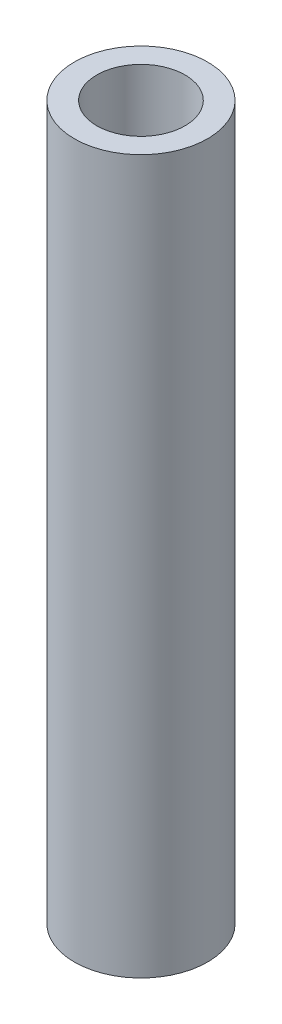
ISO-10303-21;
HEADER;
FILE_DESCRIPTION(('STEP AP214'),'2;1');
FILE_NAME('part.step','',(''),(''),'','','');
FILE_SCHEMA(('AUTOMOTIVE_DESIGN { 1 0 10303 214 1 1 1 1 }'));
ENDSEC;
DATA;
#1=APPLICATION_CONTEXT('core data for automotive mechanical design processes');
#2=APPLICATION_PROTOCOL_DEFINITION('international standard','automotive_design',2000,#1);
#3=PRODUCT_CONTEXT('',#1,'mechanical');
#4=PRODUCT('Part','Part','',(#3));
#5=PRODUCT_RELATED_PRODUCT_CATEGORY('part','',(#4));
#6=PRODUCT_DEFINITION_FORMATION('','',#4);
#7=PRODUCT_DEFINITION_CONTEXT('part definition',#1,'design');
#8=PRODUCT_DEFINITION('design','',#6,#7);
#9=PRODUCT_DEFINITION_SHAPE('','',#8);
#10=(LENGTH_UNIT() NAMED_UNIT(*) SI_UNIT(.MILLI.,.METRE.));
#11=(NAMED_UNIT(*) PLANE_ANGLE_UNIT() SI_UNIT($,.RADIAN.));
#12=(NAMED_UNIT(*) SI_UNIT($,.STERADIAN.) SOLID_ANGLE_UNIT());
#13=UNCERTAINTY_MEASURE_WITH_UNIT(LENGTH_MEASURE(1.E-05),#10,'distance_accuracy_value','');
#14=(GEOMETRIC_REPRESENTATION_CONTEXT(3) GLOBAL_UNCERTAINTY_ASSIGNED_CONTEXT((#13)) GLOBAL_UNIT_ASSIGNED_CONTEXT((#10,
#11,#12)) REPRESENTATION_CONTEXT('',''));
#15=CARTESIAN_POINT('',(0.,0.,0.));
#16=DIRECTION('',(0.,0.,1.));
#17=DIRECTION('',(1.,0.,0.));
#18=AXIS2_PLACEMENT_3D('',#15,#16,#17);
#19=CARTESIAN_POINT('',(0.,21.42,0.));
#20=DIRECTION('',(0.,-1.,0.));
#21=DIRECTION('',(0.,0.,-1.));
#22=AXIS2_PLACEMENT_3D('',#19,#20,#21);
#23=CYLINDRICAL_SURFACE('',#22,4.);
#24=CARTESIAN_POINT('',(0.,21.42,0.));
#25=DIRECTION('',(0.,1.,0.));
#26=DIRECTION('',(0.,0.,1.));
#27=AXIS2_PLACEMENT_3D('',#24,#25,#26);
#28=CIRCLE('',#27,4.);
#29=CARTESIAN_POINT('',(0.,21.42,4.));
#30=VERTEX_POINT('',#29);
#31=EDGE_CURVE('E10',#30,#30,#28,.T.);
#32=ORIENTED_EDGE('',*,*,#31,.F.);
#33=EDGE_LOOP('',(#32));
#34=FACE_BOUND('',#33,.T.);
#35=CARTESIAN_POINT('',(0.,-21.42,0.));
#36=DIRECTION('',(0.,1.,0.));
#37=DIRECTION('',(0.,0.,1.));
#38=AXIS2_PLACEMENT_3D('',#35,#36,#37);
#39=CIRCLE('',#38,4.);
#40=CARTESIAN_POINT('',(0.,-21.42,4.));
#41=VERTEX_POINT('',#40);
#42=EDGE_CURVE('E37',#41,#41,#39,.T.);
#43=ORIENTED_EDGE('',*,*,#42,.T.);
#44=EDGE_LOOP('',(#43));
#45=FACE_BOUND('',#44,.T.);
#46=ADVANCED_FACE('F34',(#34,#45),#23,.T.);
#47=CARTESIAN_POINT('',(0.,21.42,0.));
#48=DIRECTION('',(0.,1.,0.));
#49=DIRECTION('',(0.,0.,1.));
#50=AXIS2_PLACEMENT_3D('',#47,#48,#49);
#51=PLANE('',#50);
#52=CARTESIAN_POINT('',(0.,21.42,0.));
#53=DIRECTION('',(0.,1.,0.));
#54=DIRECTION('',(0.,0.,1.));
#55=AXIS2_PLACEMENT_3D('',#52,#53,#54);
#56=CIRCLE('',#55,2.65);
#57=CARTESIAN_POINT('',(0.,21.42,2.65));
#58=VERTEX_POINT('',#57);
#59=EDGE_CURVE('E52',#58,#58,#56,.T.);
#60=ORIENTED_EDGE('',*,*,#59,.F.);
#61=EDGE_LOOP('',(#60));
#62=FACE_BOUND('',#61,.T.);
#63=ORIENTED_EDGE('',*,*,#31,.T.);
#64=EDGE_LOOP('',(#63));
#65=FACE_BOUND('',#64,.T.);
#66=ADVANCED_FACE('F58',(#62,#65),#51,.T.);
#67=CARTESIAN_POINT('',(0.,-21.42,0.));
#68=DIRECTION('',(0.,1.,0.));
#69=DIRECTION('',(0.,0.,1.));
#70=AXIS2_PLACEMENT_3D('',#67,#68,#69);
#71=PLANE('',#70);
#72=CARTESIAN_POINT('',(0.,-21.42,0.));
#73=DIRECTION('',(0.,1.,0.));
#74=DIRECTION('',(0.,0.,1.));
#75=AXIS2_PLACEMENT_3D('',#72,#73,#74);
#76=CIRCLE('',#75,2.64999999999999);
#77=CARTESIAN_POINT('',(0.,-21.42,2.64999999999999));
#78=VERTEX_POINT('',#77);
#79=EDGE_CURVE('E48',#78,#78,#76,.T.);
#80=ORIENTED_EDGE('',*,*,#79,.T.);
#81=EDGE_LOOP('',(#80));
#82=FACE_BOUND('',#81,.T.);
#83=ORIENTED_EDGE('',*,*,#42,.F.);
#84=EDGE_LOOP('',(#83));
#85=FACE_BOUND('',#84,.T.);
#86=ADVANCED_FACE('F60',(#82,#85),#71,.F.);
#87=CARTESIAN_POINT('',(0.,21.42,0.));
#88=DIRECTION('',(0.,1.,0.));
#89=DIRECTION('',(0.,0.,1.));
#90=AXIS2_PLACEMENT_3D('',#87,#88,#89);
#91=CYLINDRICAL_SURFACE('',#90,2.64999999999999);
#92=ORIENTED_EDGE('',*,*,#79,.F.);
#93=EDGE_LOOP('',(#92));
#94=FACE_BOUND('',#93,.T.);
#95=ORIENTED_EDGE('',*,*,#59,.T.);
#96=EDGE_LOOP('',(#95));
#97=FACE_BOUND('',#96,.T.);
#98=ADVANCED_FACE('F56',(#94,#97),#91,.F.);
#99=CLOSED_SHELL('',(#46,#66,#86,#98));
#100=MANIFOLD_SOLID_BREP('B2',#99);
#101=ADVANCED_BREP_SHAPE_REPRESENTATION('',(#18,#100),#14);
#102=SHAPE_DEFINITION_REPRESENTATION(#9,#101);
ENDSEC;
END-ISO-10303-21;
